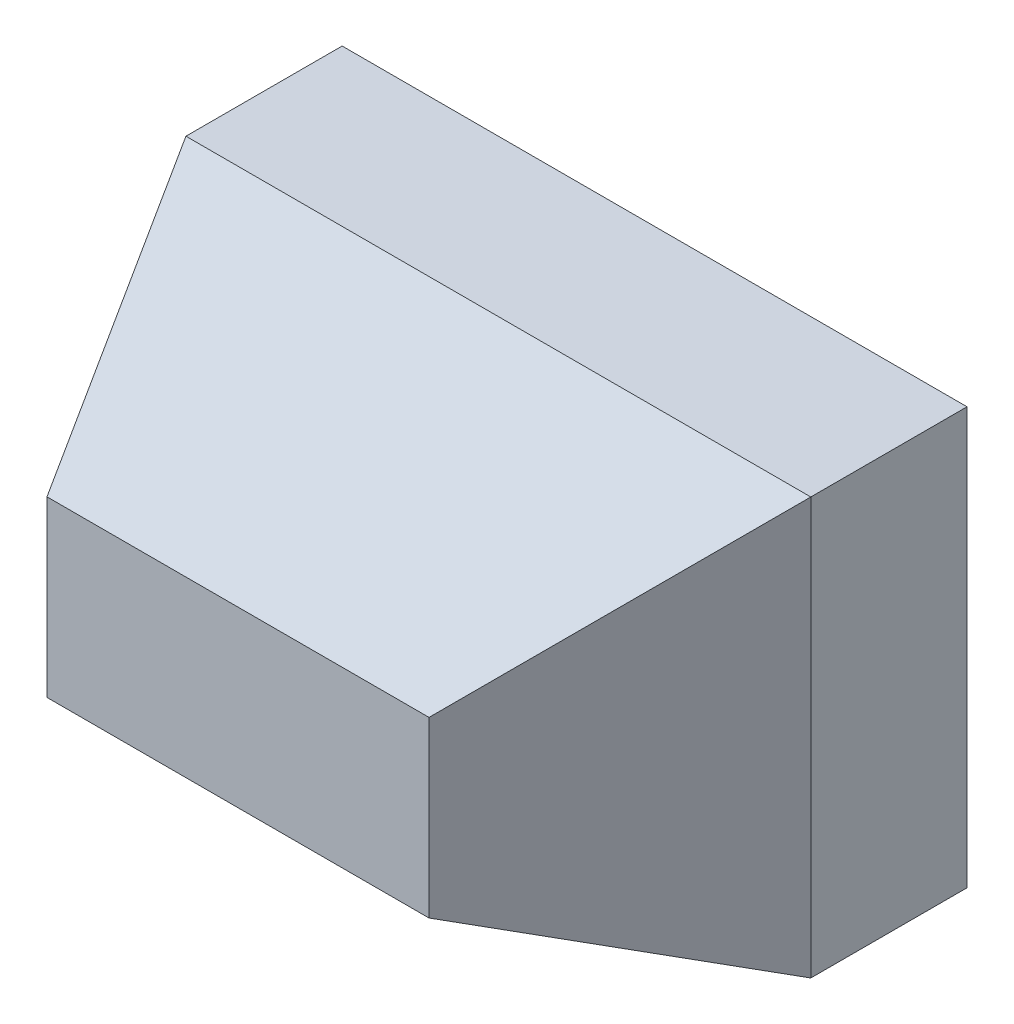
ISO-10303-21;
HEADER;
FILE_DESCRIPTION(('STEP AP214'),'2;1');
FILE_NAME('part.step','',(''),(''),'','','');
FILE_SCHEMA(('AUTOMOTIVE_DESIGN { 1 0 10303 214 1 1 1 1 }'));
ENDSEC;
DATA;
#1=APPLICATION_CONTEXT('core data for automotive mechanical design processes');
#2=APPLICATION_PROTOCOL_DEFINITION('international standard','automotive_design',2000,#1);
#3=PRODUCT_CONTEXT('',#1,'mechanical');
#4=PRODUCT('Part','Part','',(#3));
#5=PRODUCT_RELATED_PRODUCT_CATEGORY('part','',(#4));
#6=PRODUCT_DEFINITION_FORMATION('','',#4);
#7=PRODUCT_DEFINITION_CONTEXT('part definition',#1,'design');
#8=PRODUCT_DEFINITION('design','',#6,#7);
#9=PRODUCT_DEFINITION_SHAPE('','',#8);
#10=(LENGTH_UNIT() NAMED_UNIT(*) SI_UNIT(.MILLI.,.METRE.));
#11=(NAMED_UNIT(*) PLANE_ANGLE_UNIT() SI_UNIT($,.RADIAN.));
#12=(NAMED_UNIT(*) SI_UNIT($,.STERADIAN.) SOLID_ANGLE_UNIT());
#13=UNCERTAINTY_MEASURE_WITH_UNIT(LENGTH_MEASURE(1.E-05),#10,'distance_accuracy_value','');
#14=(GEOMETRIC_REPRESENTATION_CONTEXT(3) GLOBAL_UNCERTAINTY_ASSIGNED_CONTEXT((#13)) GLOBAL_UNIT_ASSIGNED_CONTEXT((#10,
#11,#12)) REPRESENTATION_CONTEXT('',''));
#15=CARTESIAN_POINT('',(0.,0.,0.));
#16=DIRECTION('',(0.,0.,1.));
#17=DIRECTION('',(1.,0.,0.));
#18=AXIS2_PLACEMENT_3D('',#15,#16,#17);
#19=CARTESIAN_POINT('',(-60.,40.,0.));
#20=DIRECTION('',(-0.90630778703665,0.,0.4226182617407));
#21=DIRECTION('',(0.4226182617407,0.,0.90630778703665));
#22=AXIS2_PLACEMENT_3D('',#19,#20,#21);
#23=PLANE('',#22);
#24=DIRECTION('',(0.,-1.,0.));
#25=VECTOR('',#24,1.);
#26=CARTESIAN_POINT('',(-60.,40.,0.));
#27=LINE('',#26,#25);
#28=CARTESIAN_POINT('',(-60.,40.,0.));
#29=VERTEX_POINT('',#28);
#30=CARTESIAN_POINT('',(-60.,-40.,0.));
#31=VERTEX_POINT('',#30);
#32=EDGE_CURVE('E107',#29,#31,#27,.T.);
#33=ORIENTED_EDGE('',*,*,#32,.T.);
#34=DIRECTION('',(-0.389281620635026,-0.389281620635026,-0.834817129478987));
#35=VECTOR('',#34,1.);
#36=CARTESIAN_POINT('',(-60.,-40.,0.));
#37=LINE('',#36,#35);
#38=CARTESIAN_POINT('',(-36.68461709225,-16.68461709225,50.));
#39=VERTEX_POINT('',#38);
#40=EDGE_CURVE('E11',#39,#31,#37,.T.);
#41=ORIENTED_EDGE('',*,*,#40,.F.);
#42=DIRECTION('',(0.,1.,0.));
#43=VECTOR('',#42,1.);
#44=CARTESIAN_POINT('',(-36.68461709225,40.,50.));
#45=LINE('',#44,#43);
#46=CARTESIAN_POINT('',(-36.68461709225,16.68461709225,50.));
#47=VERTEX_POINT('',#46);
#48=EDGE_CURVE('E121',#47,#39,#45,.F.);
#49=ORIENTED_EDGE('',*,*,#48,.F.);
#50=DIRECTION('',(-0.389281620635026,0.389281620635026,-0.834817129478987));
#51=VECTOR('',#50,1.);
#52=CARTESIAN_POINT('',(-60.,40.,0.));
#53=LINE('',#52,#51);
#54=EDGE_CURVE('E123',#47,#29,#53,.T.);
#55=ORIENTED_EDGE('',*,*,#54,.T.);
#56=EDGE_LOOP('',(#33,#41,#49,#55));
#57=FACE_BOUND('',#56,.T.);
#58=ADVANCED_FACE('F31',(#57),#23,.T.);
#59=CARTESIAN_POINT('',(-60.,-40.,0.));
#60=DIRECTION('',(0.,-0.90630778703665,0.4226182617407));
#61=DIRECTION('',(0.,-0.4226182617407,-0.90630778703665));
#62=AXIS2_PLACEMENT_3D('',#59,#60,#61);
#63=PLANE('',#62);
#64=DIRECTION('',(1.,0.,0.));
#65=VECTOR('',#64,1.);
#66=CARTESIAN_POINT('',(-60.,-40.,0.));
#67=LINE('',#66,#65);
#68=CARTESIAN_POINT('',(60.,-40.,0.));
#69=VERTEX_POINT('',#68);
#70=EDGE_CURVE('E106',#31,#69,#67,.T.);
#71=ORIENTED_EDGE('',*,*,#70,.T.);
#72=DIRECTION('',(0.389281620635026,-0.389281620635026,-0.834817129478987));
#73=VECTOR('',#72,1.);
#74=CARTESIAN_POINT('',(47.8767855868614,-27.8767855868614,25.9983172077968));
#75=LINE('',#74,#73);
#76=CARTESIAN_POINT('',(36.68461709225,-16.68461709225,50.));
#77=VERTEX_POINT('',#76);
#78=EDGE_CURVE('E40',#77,#69,#75,.T.);
#79=ORIENTED_EDGE('',*,*,#78,.F.);
#80=DIRECTION('',(-1.,0.,0.));
#81=VECTOR('',#80,1.);
#82=CARTESIAN_POINT('',(-60.,-16.68461709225,50.));
#83=LINE('',#82,#81);
#84=EDGE_CURVE('E132',#39,#77,#83,.F.);
#85=ORIENTED_EDGE('',*,*,#84,.F.);
#86=ORIENTED_EDGE('',*,*,#40,.T.);
#87=EDGE_LOOP('',(#71,#79,#85,#86));
#88=FACE_BOUND('',#87,.T.);
#89=ADVANCED_FACE('F33',(#88),#63,.T.);
#90=CARTESIAN_POINT('',(60.,40.,0.));
#91=DIRECTION('',(0.90630778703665,0.,0.4226182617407));
#92=DIRECTION('',(0.4226182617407,0.,-0.90630778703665));
#93=AXIS2_PLACEMENT_3D('',#90,#91,#92);
#94=PLANE('',#93);
#95=DIRECTION('',(0.,1.,0.));
#96=VECTOR('',#95,1.);
#97=CARTESIAN_POINT('',(60.,40.,0.));
#98=LINE('',#97,#96);
#99=CARTESIAN_POINT('',(60.,40.,0.));
#100=VERTEX_POINT('',#99);
#101=EDGE_CURVE('E116',#69,#100,#98,.T.);
#102=ORIENTED_EDGE('',*,*,#101,.T.);
#103=DIRECTION('',(0.389281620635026,0.389281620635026,-0.834817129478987));
#104=VECTOR('',#103,1.);
#105=CARTESIAN_POINT('',(41.8151783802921,21.8151783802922,38.9974758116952));
#106=LINE('',#105,#104);
#107=CARTESIAN_POINT('',(36.68461709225,16.68461709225,50.));
#108=VERTEX_POINT('',#107);
#109=EDGE_CURVE('E126',#108,#100,#106,.T.);
#110=ORIENTED_EDGE('',*,*,#109,.F.);
#111=DIRECTION('',(0.,-1.,0.));
#112=VECTOR('',#111,1.);
#113=CARTESIAN_POINT('',(36.68461709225,40.,50.));
#114=LINE('',#113,#112);
#115=EDGE_CURVE('E52',#77,#108,#114,.F.);
#116=ORIENTED_EDGE('',*,*,#115,.F.);
#117=ORIENTED_EDGE('',*,*,#78,.T.);
#118=EDGE_LOOP('',(#102,#110,#116,#117));
#119=FACE_BOUND('',#118,.T.);
#120=ADVANCED_FACE('F139',(#119),#94,.T.);
#121=CARTESIAN_POINT('',(-60.,40.,0.));
#122=DIRECTION('',(0.,0.90630778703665,0.4226182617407));
#123=DIRECTION('',(0.,-0.4226182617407,0.90630778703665));
#124=AXIS2_PLACEMENT_3D('',#121,#122,#123);
#125=PLANE('',#124);
#126=DIRECTION('',(-1.,0.,0.));
#127=VECTOR('',#126,1.);
#128=CARTESIAN_POINT('',(-60.,40.,0.));
#129=LINE('',#128,#127);
#130=EDGE_CURVE('E119',#100,#29,#129,.T.);
#131=ORIENTED_EDGE('',*,*,#130,.T.);
#132=ORIENTED_EDGE('',*,*,#54,.F.);
#133=DIRECTION('',(1.,0.,0.));
#134=VECTOR('',#133,1.);
#135=CARTESIAN_POINT('',(-60.,16.68461709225,50.));
#136=LINE('',#135,#134);
#137=EDGE_CURVE('E35',#108,#47,#136,.F.);
#138=ORIENTED_EDGE('',*,*,#137,.F.);
#139=ORIENTED_EDGE('',*,*,#109,.T.);
#140=EDGE_LOOP('',(#131,#132,#138,#139));
#141=FACE_BOUND('',#140,.T.);
#142=ADVANCED_FACE('F142',(#141),#125,.T.);
#143=CARTESIAN_POINT('',(-60.,-40.,50.));
#144=DIRECTION('',(0.,0.,1.));
#145=DIRECTION('',(1.,0.,0.));
#146=AXIS2_PLACEMENT_3D('',#143,#144,#145);
#147=PLANE('',#146);
#148=ORIENTED_EDGE('',*,*,#48,.T.);
#149=ORIENTED_EDGE('',*,*,#84,.T.);
#150=ORIENTED_EDGE('',*,*,#115,.T.);
#151=ORIENTED_EDGE('',*,*,#137,.T.);
#152=EDGE_LOOP('',(#148,#149,#150,#151));
#153=FACE_BOUND('',#152,.T.);
#154=ADVANCED_FACE('F134',(#153),#147,.T.);
#155=CARTESIAN_POINT('',(60.,-40.,-30.));
#156=DIRECTION('',(0.,1.,0.));
#157=DIRECTION('',(-1.,0.,0.));
#158=AXIS2_PLACEMENT_3D('',#155,#156,#157);
#159=PLANE('',#158);
#160=ORIENTED_EDGE('',*,*,#70,.F.);
#161=DIRECTION('',(0.,0.,1.));
#162=VECTOR('',#161,1.);
#163=CARTESIAN_POINT('',(-60.,-40.,-30.));
#164=LINE('',#163,#162);
#165=CARTESIAN_POINT('',(-60.,-40.,-30.));
#166=VERTEX_POINT('',#165);
#167=EDGE_CURVE('E88',#166,#31,#164,.T.);
#168=ORIENTED_EDGE('',*,*,#167,.F.);
#169=DIRECTION('',(-1.,0.,0.));
#170=VECTOR('',#169,1.);
#171=CARTESIAN_POINT('',(60.,-40.,-30.));
#172=LINE('',#171,#170);
#173=CARTESIAN_POINT('',(60.,-40.,-30.));
#174=VERTEX_POINT('',#173);
#175=EDGE_CURVE('E95',#174,#166,#172,.T.);
#176=ORIENTED_EDGE('',*,*,#175,.F.);
#177=DIRECTION('',(0.,0.,1.));
#178=VECTOR('',#177,1.);
#179=CARTESIAN_POINT('',(60.,-40.,-30.));
#180=LINE('',#179,#178);
#181=EDGE_CURVE('E149',#174,#69,#180,.T.);
#182=ORIENTED_EDGE('',*,*,#181,.T.);
#183=EDGE_LOOP('',(#160,#168,#176,#182));
#184=FACE_BOUND('',#183,.T.);
#185=ADVANCED_FACE('F104',(#184),#159,.F.);
#186=CARTESIAN_POINT('',(-60.,-40.,-30.));
#187=DIRECTION('',(1.,0.,0.));
#188=DIRECTION('',(0.,0.,-1.));
#189=AXIS2_PLACEMENT_3D('',#186,#187,#188);
#190=PLANE('',#189);
#191=ORIENTED_EDGE('',*,*,#32,.F.);
#192=DIRECTION('',(0.,0.,1.));
#193=VECTOR('',#192,1.);
#194=CARTESIAN_POINT('',(-60.,40.,-30.));
#195=LINE('',#194,#193);
#196=CARTESIAN_POINT('',(-60.,40.,-30.));
#197=VERTEX_POINT('',#196);
#198=EDGE_CURVE('E91',#197,#29,#195,.T.);
#199=ORIENTED_EDGE('',*,*,#198,.F.);
#200=DIRECTION('',(0.,1.,0.));
#201=VECTOR('',#200,1.);
#202=CARTESIAN_POINT('',(-60.,-40.,-30.));
#203=LINE('',#202,#201);
#204=EDGE_CURVE('E84',#166,#197,#203,.T.);
#205=ORIENTED_EDGE('',*,*,#204,.F.);
#206=ORIENTED_EDGE('',*,*,#167,.T.);
#207=EDGE_LOOP('',(#191,#199,#205,#206));
#208=FACE_BOUND('',#207,.T.);
#209=ADVANCED_FACE('F86',(#208),#190,.F.);
#210=CARTESIAN_POINT('',(-60.,40.,-30.));
#211=DIRECTION('',(0.,-1.,0.));
#212=DIRECTION('',(1.,0.,0.));
#213=AXIS2_PLACEMENT_3D('',#210,#211,#212);
#214=PLANE('',#213);
#215=ORIENTED_EDGE('',*,*,#130,.F.);
#216=DIRECTION('',(0.,0.,1.));
#217=VECTOR('',#216,1.);
#218=CARTESIAN_POINT('',(60.,40.,-30.));
#219=LINE('',#218,#217);
#220=CARTESIAN_POINT('',(60.,40.,-30.));
#221=VERTEX_POINT('',#220);
#222=EDGE_CURVE('E111',#221,#100,#219,.T.);
#223=ORIENTED_EDGE('',*,*,#222,.F.);
#224=DIRECTION('',(1.,0.,0.));
#225=VECTOR('',#224,1.);
#226=CARTESIAN_POINT('',(-60.,40.,-30.));
#227=LINE('',#226,#225);
#228=EDGE_CURVE('E94',#197,#221,#227,.T.);
#229=ORIENTED_EDGE('',*,*,#228,.F.);
#230=ORIENTED_EDGE('',*,*,#198,.T.);
#231=EDGE_LOOP('',(#215,#223,#229,#230));
#232=FACE_BOUND('',#231,.T.);
#233=ADVANCED_FACE('F145',(#232),#214,.F.);
#234=CARTESIAN_POINT('',(60.,40.,-30.));
#235=DIRECTION('',(-1.,0.,0.));
#236=DIRECTION('',(0.,0.,1.));
#237=AXIS2_PLACEMENT_3D('',#234,#235,#236);
#238=PLANE('',#237);
#239=ORIENTED_EDGE('',*,*,#101,.F.);
#240=ORIENTED_EDGE('',*,*,#181,.F.);
#241=DIRECTION('',(0.,-1.,0.));
#242=VECTOR('',#241,1.);
#243=CARTESIAN_POINT('',(60.,40.,-30.));
#244=LINE('',#243,#242);
#245=EDGE_CURVE('E100',#221,#174,#244,.T.);
#246=ORIENTED_EDGE('',*,*,#245,.F.);
#247=ORIENTED_EDGE('',*,*,#222,.T.);
#248=EDGE_LOOP('',(#239,#240,#246,#247));
#249=FACE_BOUND('',#248,.T.);
#250=ADVANCED_FACE('F153',(#249),#238,.F.);
#251=CARTESIAN_POINT('',(-60.,-40.,-30.));
#252=DIRECTION('',(0.,0.,-1.));
#253=DIRECTION('',(-1.,0.,0.));
#254=AXIS2_PLACEMENT_3D('',#251,#252,#253);
#255=PLANE('',#254);
#256=ORIENTED_EDGE('',*,*,#175,.T.);
#257=ORIENTED_EDGE('',*,*,#204,.T.);
#258=ORIENTED_EDGE('',*,*,#228,.T.);
#259=ORIENTED_EDGE('',*,*,#245,.T.);
#260=EDGE_LOOP('',(#256,#257,#258,#259));
#261=FACE_BOUND('',#260,.T.);
#262=ADVANCED_FACE('F98',(#261),#255,.T.);
#263=CLOSED_SHELL('',(#58,#89,#120,#142,#154,#185,#209,#233,#250,#262));
#264=MANIFOLD_SOLID_BREP('B2',#263);
#265=ADVANCED_BREP_SHAPE_REPRESENTATION('',(#18,#264),#14);
#266=SHAPE_DEFINITION_REPRESENTATION(#9,#265);
ENDSEC;
END-ISO-10303-21;
